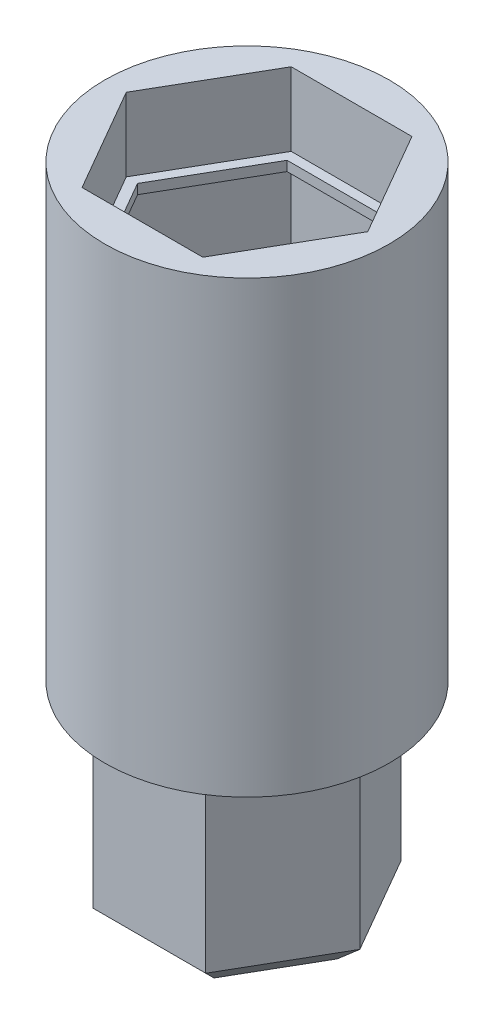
ISO-10303-21;
HEADER;
FILE_DESCRIPTION(('STEP AP214'),'2;1');
FILE_NAME('part.step','',(''),(''),'','','');
FILE_SCHEMA(('AUTOMOTIVE_DESIGN { 1 0 10303 214 1 1 1 1 }'));
ENDSEC;
DATA;
#1=APPLICATION_CONTEXT('core data for automotive mechanical design processes');
#2=APPLICATION_PROTOCOL_DEFINITION('international standard','automotive_design',2000,#1);
#3=PRODUCT_CONTEXT('',#1,'mechanical');
#4=PRODUCT('Part','Part','',(#3));
#5=PRODUCT_RELATED_PRODUCT_CATEGORY('part','',(#4));
#6=PRODUCT_DEFINITION_FORMATION('','',#4);
#7=PRODUCT_DEFINITION_CONTEXT('part definition',#1,'design');
#8=PRODUCT_DEFINITION('design','',#6,#7);
#9=PRODUCT_DEFINITION_SHAPE('','',#8);
#10=(LENGTH_UNIT() NAMED_UNIT(*) SI_UNIT(.MILLI.,.METRE.));
#11=(NAMED_UNIT(*) PLANE_ANGLE_UNIT() SI_UNIT($,.RADIAN.));
#12=(NAMED_UNIT(*) SI_UNIT($,.STERADIAN.) SOLID_ANGLE_UNIT());
#13=UNCERTAINTY_MEASURE_WITH_UNIT(LENGTH_MEASURE(1.E-05),#10,'distance_accuracy_value','');
#14=(GEOMETRIC_REPRESENTATION_CONTEXT(3) GLOBAL_UNCERTAINTY_ASSIGNED_CONTEXT((#13)) GLOBAL_UNIT_ASSIGNED_CONTEXT((#10,
#11,#12)) REPRESENTATION_CONTEXT('',''));
#15=CARTESIAN_POINT('',(0.,0.,0.));
#16=DIRECTION('',(0.,0.,1.));
#17=DIRECTION('',(1.,0.,0.));
#18=AXIS2_PLACEMENT_3D('',#15,#16,#17);
#19=CARTESIAN_POINT('',(0.,0.,0.));
#20=DIRECTION('',(0.,1.,0.));
#21=DIRECTION('',(0.,0.,1.));
#22=AXIS2_PLACEMENT_3D('',#19,#20,#21);
#23=PLANE('',#22);
#24=DIRECTION('',(-0.5,0.,-0.866025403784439));
#25=VECTOR('',#24,1.);
#26=CARTESIAN_POINT('',(9.5320529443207,0.,-13.97));
#27=LINE('',#26,#25);
#28=CARTESIAN_POINT('',(17.5976362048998,0.,0.));
#29=VERTEX_POINT('',#28);
#30=CARTESIAN_POINT('',(8.79881810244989,0.,-15.24));
#31=VERTEX_POINT('',#30);
#32=EDGE_CURVE('E445',#29,#31,#27,.T.);
#33=ORIENTED_EDGE('',*,*,#32,.T.);
#34=DIRECTION('',(-1.,0.,0.));
#35=VECTOR('',#34,1.);
#36=CARTESIAN_POINT('',(-7.33234841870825,0.,-15.24));
#37=LINE('',#36,#35);
#38=CARTESIAN_POINT('',(-8.79881810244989,0.,-15.24));
#39=VERTEX_POINT('',#38);
#40=EDGE_CURVE('E453',#31,#39,#37,.T.);
#41=ORIENTED_EDGE('',*,*,#40,.T.);
#42=DIRECTION('',(-0.5,0.,0.866025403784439));
#43=VECTOR('',#42,1.);
#44=CARTESIAN_POINT('',(-16.864401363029,0.,-1.26999999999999));
#45=LINE('',#44,#43);
#46=CARTESIAN_POINT('',(-17.5976362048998,0.,0.));
#47=VERTEX_POINT('',#46);
#48=EDGE_CURVE('E451',#39,#47,#45,.T.);
#49=ORIENTED_EDGE('',*,*,#48,.T.);
#50=DIRECTION('',(0.5,0.,0.866025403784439));
#51=VECTOR('',#50,1.);
#52=CARTESIAN_POINT('',(-9.53205294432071,0.,13.97));
#53=LINE('',#52,#51);
#54=CARTESIAN_POINT('',(-8.79881810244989,0.,15.24));
#55=VERTEX_POINT('',#54);
#56=EDGE_CURVE('E449',#47,#55,#53,.T.);
#57=ORIENTED_EDGE('',*,*,#56,.T.);
#58=DIRECTION('',(1.,0.,0.));
#59=VECTOR('',#58,1.);
#60=CARTESIAN_POINT('',(7.33234841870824,0.,15.24));
#61=LINE('',#60,#59);
#62=CARTESIAN_POINT('',(8.79881810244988,0.,15.24));
#63=VERTEX_POINT('',#62);
#64=EDGE_CURVE('E447',#55,#63,#61,.T.);
#65=ORIENTED_EDGE('',*,*,#64,.T.);
#66=DIRECTION('',(0.5,0.,-0.866025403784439));
#67=VECTOR('',#66,1.);
#68=CARTESIAN_POINT('',(16.8644013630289,0.,1.27));
#69=LINE('',#68,#67);
#70=EDGE_CURVE('E443',#63,#29,#69,.T.);
#71=ORIENTED_EDGE('',*,*,#70,.T.);
#72=EDGE_LOOP('',(#33,#41,#49,#57,#65,#71));
#73=FACE_BOUND('',#72,.T.);
#74=CARTESIAN_POINT('',(0.,0.,0.));
#75=DIRECTION('',(0.,1.,0.));
#76=DIRECTION('',(0.,0.,1.));
#77=AXIS2_PLACEMENT_3D('',#74,#75,#76);
#78=CIRCLE('',#77,18.4785);
#79=CARTESIAN_POINT('',(0.,0.,-18.4785));
#80=VERTEX_POINT('',#79);
#81=EDGE_CURVE('E384',#80,#80,#78,.T.);
#82=ORIENTED_EDGE('',*,*,#81,.F.);
#83=EDGE_LOOP('',(#82));
#84=FACE_BOUND('',#83,.T.);
#85=ADVANCED_FACE('F33',(#73,#84),#23,.F.);
#86=CARTESIAN_POINT('',(0.,58.42,0.));
#87=DIRECTION('',(0.,-1.,0.));
#88=DIRECTION('',(0.,0.,-1.));
#89=AXIS2_PLACEMENT_3D('',#86,#87,#88);
#90=CYLINDRICAL_SURFACE('',#89,18.4785);
#91=CARTESIAN_POINT('',(0.,58.42,0.));
#92=DIRECTION('',(0.,1.,0.));
#93=DIRECTION('',(0.,0.,1.));
#94=AXIS2_PLACEMENT_3D('',#91,#92,#93);
#95=CIRCLE('',#94,18.4785);
#96=CARTESIAN_POINT('',(0.,58.42,-18.4785));
#97=VERTEX_POINT('',#96);
#98=EDGE_CURVE('E395',#97,#97,#95,.T.);
#99=CARTESIAN_POINT('',(0.,58.42,-18.4785));
#100=CARTESIAN_POINT('',(0.,57.8114583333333,-18.4785));
#101=CARTESIAN_POINT('',(0.,57.2029166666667,-18.4785));
#102=CARTESIAN_POINT('',(0.,55.9858333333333,-18.4785));
#103=CARTESIAN_POINT('',(0.,55.3772916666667,-18.4785));
#104=CARTESIAN_POINT('',(0.,54.1602083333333,-18.4785));
#105=CARTESIAN_POINT('',(0.,53.5516666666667,-18.4785));
#106=CARTESIAN_POINT('',(0.,52.3345833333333,-18.4785));
#107=CARTESIAN_POINT('',(0.,51.7260416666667,-18.4785));
#108=CARTESIAN_POINT('',(0.,50.5089583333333,-18.4785));
#109=CARTESIAN_POINT('',(0.,49.9004166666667,-18.4785));
#110=CARTESIAN_POINT('',(0.,48.6833333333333,-18.4785));
#111=CARTESIAN_POINT('',(0.,48.0747916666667,-18.4785));
#112=CARTESIAN_POINT('',(0.,46.8577083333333,-18.4785));
#113=CARTESIAN_POINT('',(0.,46.2491666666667,-18.4785));
#114=CARTESIAN_POINT('',(0.,45.0320833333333,-18.4785));
#115=CARTESIAN_POINT('',(0.,44.4235416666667,-18.4785));
#116=CARTESIAN_POINT('',(0.,43.2064583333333,-18.4785));
#117=CARTESIAN_POINT('',(0.,42.5979166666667,-18.4785));
#118=CARTESIAN_POINT('',(0.,41.3808333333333,-18.4785));
#119=CARTESIAN_POINT('',(0.,40.7722916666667,-18.4785));
#120=CARTESIAN_POINT('',(0.,39.5552083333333,-18.4785));
#121=CARTESIAN_POINT('',(0.,38.9466666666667,-18.4785));
#122=CARTESIAN_POINT('',(0.,37.7295833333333,-18.4785));
#123=CARTESIAN_POINT('',(0.,37.1210416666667,-18.4785));
#124=CARTESIAN_POINT('',(0.,35.9039583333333,-18.4785));
#125=CARTESIAN_POINT('',(0.,35.2954166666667,-18.4785));
#126=CARTESIAN_POINT('',(0.,34.0783333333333,-18.4785));
#127=CARTESIAN_POINT('',(0.,33.4697916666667,-18.4785));
#128=CARTESIAN_POINT('',(0.,32.2527083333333,-18.4785));
#129=CARTESIAN_POINT('',(0.,31.6441666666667,-18.4785));
#130=CARTESIAN_POINT('',(0.,30.4270833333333,-18.4785));
#131=CARTESIAN_POINT('',(0.,29.8185416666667,-18.4785));
#132=CARTESIAN_POINT('',(0.,28.6014583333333,-18.4785));
#133=CARTESIAN_POINT('',(0.,27.9929166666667,-18.4785));
#134=CARTESIAN_POINT('',(0.,26.7758333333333,-18.4785));
#135=CARTESIAN_POINT('',(0.,26.1672916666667,-18.4785));
#136=CARTESIAN_POINT('',(0.,24.9502083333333,-18.4785));
#137=CARTESIAN_POINT('',(0.,24.3416666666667,-18.4785));
#138=CARTESIAN_POINT('',(0.,23.1245833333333,-18.4785));
#139=CARTESIAN_POINT('',(0.,22.5160416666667,-18.4785));
#140=CARTESIAN_POINT('',(0.,21.2989583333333,-18.4785));
#141=CARTESIAN_POINT('',(0.,20.6904166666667,-18.4785));
#142=CARTESIAN_POINT('',(0.,19.4733333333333,-18.4785));
#143=CARTESIAN_POINT('',(0.,18.8647916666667,-18.4785));
#144=CARTESIAN_POINT('',(0.,17.6477083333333,-18.4785));
#145=CARTESIAN_POINT('',(0.,17.0391666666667,-18.4785));
#146=CARTESIAN_POINT('',(0.,15.8220833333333,-18.4785));
#147=CARTESIAN_POINT('',(0.,15.2135416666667,-18.4785));
#148=CARTESIAN_POINT('',(0.,13.9964583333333,-18.4785));
#149=CARTESIAN_POINT('',(0.,13.3879166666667,-18.4785));
#150=CARTESIAN_POINT('',(0.,12.1708333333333,-18.4785));
#151=CARTESIAN_POINT('',(0.,11.5622916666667,-18.4785));
#152=CARTESIAN_POINT('',(0.,10.3452083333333,-18.4785));
#153=CARTESIAN_POINT('',(0.,9.73666666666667,-18.4785));
#154=CARTESIAN_POINT('',(0.,8.51958333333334,-18.4785));
#155=CARTESIAN_POINT('',(0.,7.91104166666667,-18.4785));
#156=CARTESIAN_POINT('',(0.,6.69395833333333,-18.4785));
#157=CARTESIAN_POINT('',(0.,6.08541666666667,-18.4785));
#158=CARTESIAN_POINT('',(0.,4.86833333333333,-18.4785));
#159=CARTESIAN_POINT('',(0.,4.25979166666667,-18.4785));
#160=CARTESIAN_POINT('',(0.,3.04270833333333,-18.4785));
#161=CARTESIAN_POINT('',(0.,2.43416666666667,-18.4785));
#162=CARTESIAN_POINT('',(0.,1.21708333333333,-18.4785));
#163=CARTESIAN_POINT('',(0.,0.608541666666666,-18.4785));
#164=CARTESIAN_POINT('',(0.,0.,-18.4785));
#165=B_SPLINE_CURVE_WITH_KNOTS('',3,(#99,#100,#101,#102,#103,#104,#105,#106,#107,#108,#109,#110,
#111,#112,#113,#114,#115,#116,#117,#118,#119,#120,#121,#122,#123,#124,#125,#126,#127,#128,#129,
#130,#131,#132,#133,#134,#135,#136,#137,#138,#139,#140,#141,#142,#143,#144,#145,#146,#147,#148,
#149,#150,#151,#152,#153,#154,#155,#156,#157,#158,#159,#160,#161,#162,#163,#164),.UNSPECIFIED.,
.F.,.F.,(4,2,2,2,2,2,2,2,2,2,2,2,2,2,2,2,2,2,2,2,2,2,2,2,2,2,2,2,2,2,2,2,4),(0.,1.825625,
3.65125,5.476875,7.3025,9.128125,10.95375,12.779375,14.605,16.430625,18.25625,20.081875,21.9075,
23.733125,25.55875,27.384375,29.21,31.035625,32.86125,34.686875,36.5125,38.338125,40.16375,
41.989375,43.815,45.640625,47.46625,49.291875,51.1175,52.943125,54.76875,56.594375,58.42),.UNSPECIFIED.);
#166=EDGE_CURVE('BSEAM601',#97,#80,#165,.T.);
#167=ORIENTED_EDGE('',*,*,#98,.F.);
#168=ORIENTED_EDGE('',*,*,#81,.T.);
#169=ORIENTED_EDGE('',*,*,#166,.T.);
#170=ORIENTED_EDGE('',*,*,#166,.F.);
#171=EDGE_LOOP('',(#167,#169,#168,#170));
#172=FACE_BOUND('',#171,.T.);
#173=ADVANCED_FACE('F601',(#172),#90,.T.);
#174=CARTESIAN_POINT('',(0.,58.42,0.));
#175=DIRECTION('',(0.,1.,0.));
#176=DIRECTION('',(0.,0.,1.));
#177=AXIS2_PLACEMENT_3D('',#174,#175,#176);
#178=PLANE('',#177);
#179=DIRECTION('',(0.5,0.,-0.866025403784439));
#180=VECTOR('',#179,1.);
#181=CARTESIAN_POINT('',(7.84561280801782,58.42,13.589));
#182=LINE('',#181,#180);
#183=CARTESIAN_POINT('',(7.84561280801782,58.42,13.589));
#184=VERTEX_POINT('',#183);
#185=CARTESIAN_POINT('',(15.6912256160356,58.42,0.));
#186=VERTEX_POINT('',#185);
#187=EDGE_CURVE('E337',#184,#186,#182,.T.);
#188=ORIENTED_EDGE('',*,*,#187,.F.);
#189=DIRECTION('',(1.,0.,0.));
#190=VECTOR('',#189,1.);
#191=CARTESIAN_POINT('',(-7.84561280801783,58.42,13.589));
#192=LINE('',#191,#190);
#193=CARTESIAN_POINT('',(-7.84561280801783,58.42,13.589));
#194=VERTEX_POINT('',#193);
#195=EDGE_CURVE('E351',#194,#184,#192,.T.);
#196=ORIENTED_EDGE('',*,*,#195,.F.);
#197=DIRECTION('',(0.5,0.,0.866025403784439));
#198=VECTOR('',#197,1.);
#199=CARTESIAN_POINT('',(-15.6912256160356,58.42,0.));
#200=LINE('',#199,#198);
#201=CARTESIAN_POINT('',(-15.6912256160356,58.42,0.));
#202=VERTEX_POINT('',#201);
#203=EDGE_CURVE('E377',#202,#194,#200,.T.);
#204=ORIENTED_EDGE('',*,*,#203,.F.);
#205=DIRECTION('',(-0.5,0.,0.866025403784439));
#206=VECTOR('',#205,1.);
#207=CARTESIAN_POINT('',(-7.84561280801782,58.42,-13.589));
#208=LINE('',#207,#206);
#209=CARTESIAN_POINT('',(-7.84561280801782,58.42,-13.589));
#210=VERTEX_POINT('',#209);
#211=EDGE_CURVE('E374',#210,#202,#208,.T.);
#212=ORIENTED_EDGE('',*,*,#211,.F.);
#213=DIRECTION('',(-1.,0.,0.));
#214=VECTOR('',#213,1.);
#215=CARTESIAN_POINT('',(7.84561280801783,58.42,-13.589));
#216=LINE('',#215,#214);
#217=CARTESIAN_POINT('',(7.84561280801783,58.42,-13.589));
#218=VERTEX_POINT('',#217);
#219=EDGE_CURVE('E371',#218,#210,#216,.T.);
#220=ORIENTED_EDGE('',*,*,#219,.F.);
#221=DIRECTION('',(-0.5,0.,-0.866025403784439));
#222=VECTOR('',#221,1.);
#223=CARTESIAN_POINT('',(15.6912256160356,58.42,0.));
#224=LINE('',#223,#222);
#225=EDGE_CURVE('E368',#186,#218,#224,.T.);
#226=ORIENTED_EDGE('',*,*,#225,.F.);
#227=EDGE_LOOP('',(#188,#196,#204,#212,#220,#226));
#228=FACE_BOUND('',#227,.T.);
#229=ORIENTED_EDGE('',*,*,#98,.T.);
#230=EDGE_LOOP('',(#229));
#231=FACE_BOUND('',#230,.T.);
#232=ADVANCED_FACE('F606',(#228,#231),#178,.T.);
#233=CARTESIAN_POINT('',(7.84561280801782,48.895,13.589));
#234=DIRECTION('',(0.866025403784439,0.,0.5));
#235=DIRECTION('',(0.5,0.,-0.866025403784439));
#236=AXIS2_PLACEMENT_3D('',#233,#234,#235);
#237=PLANE('',#236);
#238=ORIENTED_EDGE('',*,*,#187,.T.);
#239=DIRECTION('',(0.,1.,0.));
#240=VECTOR('',#239,1.);
#241=CARTESIAN_POINT('',(15.6912256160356,48.895,0.));
#242=LINE('',#241,#240);
#243=CARTESIAN_POINT('',(15.6912256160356,48.895,0.));
#244=VERTEX_POINT('',#243);
#245=EDGE_CURVE('E366',#244,#186,#242,.T.);
#246=ORIENTED_EDGE('',*,*,#245,.F.);
#247=DIRECTION('',(0.5,0.,-0.866025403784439));
#248=VECTOR('',#247,1.);
#249=CARTESIAN_POINT('',(7.84561280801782,48.895,13.589));
#250=LINE('',#249,#248);
#251=CARTESIAN_POINT('',(7.84561280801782,48.895,13.589));
#252=VERTEX_POINT('',#251);
#253=EDGE_CURVE('E347',#252,#244,#250,.T.);
#254=ORIENTED_EDGE('',*,*,#253,.F.);
#255=DIRECTION('',(0.,1.,0.));
#256=VECTOR('',#255,1.);
#257=CARTESIAN_POINT('',(7.84561280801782,48.895,13.589));
#258=LINE('',#257,#256);
#259=EDGE_CURVE('E382',#252,#184,#258,.T.);
#260=ORIENTED_EDGE('',*,*,#259,.T.);
#261=EDGE_LOOP('',(#238,#246,#254,#260));
#262=FACE_BOUND('',#261,.T.);
#263=ADVANCED_FACE('F983',(#262),#237,.F.);
#264=CARTESIAN_POINT('',(-7.84561280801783,48.895,13.589));
#265=DIRECTION('',(0.,0.,1.));
#266=DIRECTION('',(1.,0.,0.));
#267=AXIS2_PLACEMENT_3D('',#264,#265,#266);
#268=PLANE('',#267);
#269=ORIENTED_EDGE('',*,*,#195,.T.);
#270=ORIENTED_EDGE('',*,*,#259,.F.);
#271=DIRECTION('',(1.,0.,0.));
#272=VECTOR('',#271,1.);
#273=CARTESIAN_POINT('',(-7.84561280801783,48.895,13.589));
#274=LINE('',#273,#272);
#275=CARTESIAN_POINT('',(-7.84561280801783,48.895,13.589));
#276=VERTEX_POINT('',#275);
#277=EDGE_CURVE('E363',#276,#252,#274,.T.);
#278=ORIENTED_EDGE('',*,*,#277,.F.);
#279=DIRECTION('',(0.,1.,0.));
#280=VECTOR('',#279,1.);
#281=CARTESIAN_POINT('',(-7.84561280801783,48.895,13.589));
#282=LINE('',#281,#280);
#283=EDGE_CURVE('E385',#276,#194,#282,.T.);
#284=ORIENTED_EDGE('',*,*,#283,.T.);
#285=EDGE_LOOP('',(#269,#270,#278,#284));
#286=FACE_BOUND('',#285,.T.);
#287=ADVANCED_FACE('F974',(#286),#268,.F.);
#288=CARTESIAN_POINT('',(-15.6912256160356,48.895,0.));
#289=DIRECTION('',(-0.866025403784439,0.,0.5));
#290=DIRECTION('',(0.5,0.,0.866025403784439));
#291=AXIS2_PLACEMENT_3D('',#288,#289,#290);
#292=PLANE('',#291);
#293=ORIENTED_EDGE('',*,*,#203,.T.);
#294=ORIENTED_EDGE('',*,*,#283,.F.);
#295=DIRECTION('',(0.5,0.,0.866025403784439));
#296=VECTOR('',#295,1.);
#297=CARTESIAN_POINT('',(-15.6912256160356,48.895,0.));
#298=LINE('',#297,#296);
#299=CARTESIAN_POINT('',(-15.6912256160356,48.895,0.));
#300=VERTEX_POINT('',#299);
#301=EDGE_CURVE('E360',#300,#276,#298,.T.);
#302=ORIENTED_EDGE('',*,*,#301,.F.);
#303=DIRECTION('',(0.,1.,0.));
#304=VECTOR('',#303,1.);
#305=CARTESIAN_POINT('',(-15.6912256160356,48.895,0.));
#306=LINE('',#305,#304);
#307=EDGE_CURVE('E387',#300,#202,#306,.T.);
#308=ORIENTED_EDGE('',*,*,#307,.T.);
#309=EDGE_LOOP('',(#293,#294,#302,#308));
#310=FACE_BOUND('',#309,.T.);
#311=ADVANCED_FACE('F965',(#310),#292,.F.);
#312=CARTESIAN_POINT('',(-7.84561280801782,48.895,-13.589));
#313=DIRECTION('',(-0.866025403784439,0.,-0.5));
#314=DIRECTION('',(-0.5,0.,0.866025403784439));
#315=AXIS2_PLACEMENT_3D('',#312,#313,#314);
#316=PLANE('',#315);
#317=ORIENTED_EDGE('',*,*,#211,.T.);
#318=ORIENTED_EDGE('',*,*,#307,.F.);
#319=DIRECTION('',(-0.5,0.,0.866025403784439));
#320=VECTOR('',#319,1.);
#321=CARTESIAN_POINT('',(-7.84561280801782,48.895,-13.589));
#322=LINE('',#321,#320);
#323=CARTESIAN_POINT('',(-7.84561280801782,48.895,-13.589));
#324=VERTEX_POINT('',#323);
#325=EDGE_CURVE('E357',#324,#300,#322,.T.);
#326=ORIENTED_EDGE('',*,*,#325,.F.);
#327=DIRECTION('',(0.,1.,0.));
#328=VECTOR('',#327,1.);
#329=CARTESIAN_POINT('',(-7.84561280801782,48.895,-13.589));
#330=LINE('',#329,#328);
#331=EDGE_CURVE('E389',#324,#210,#330,.T.);
#332=ORIENTED_EDGE('',*,*,#331,.T.);
#333=EDGE_LOOP('',(#317,#318,#326,#332));
#334=FACE_BOUND('',#333,.T.);
#335=ADVANCED_FACE('F956',(#334),#316,.F.);
#336=CARTESIAN_POINT('',(7.84561280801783,48.895,-13.589));
#337=DIRECTION('',(0.,0.,-1.));
#338=DIRECTION('',(-1.,0.,0.));
#339=AXIS2_PLACEMENT_3D('',#336,#337,#338);
#340=PLANE('',#339);
#341=ORIENTED_EDGE('',*,*,#219,.T.);
#342=ORIENTED_EDGE('',*,*,#331,.F.);
#343=DIRECTION('',(-1.,0.,0.));
#344=VECTOR('',#343,1.);
#345=CARTESIAN_POINT('',(7.84561280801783,48.895,-13.589));
#346=LINE('',#345,#344);
#347=CARTESIAN_POINT('',(7.84561280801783,48.895,-13.589));
#348=VERTEX_POINT('',#347);
#349=EDGE_CURVE('E354',#348,#324,#346,.T.);
#350=ORIENTED_EDGE('',*,*,#349,.F.);
#351=DIRECTION('',(0.,1.,0.));
#352=VECTOR('',#351,1.);
#353=CARTESIAN_POINT('',(7.84561280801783,48.895,-13.589));
#354=LINE('',#353,#352);
#355=EDGE_CURVE('E391',#348,#218,#354,.T.);
#356=ORIENTED_EDGE('',*,*,#355,.T.);
#357=EDGE_LOOP('',(#341,#342,#350,#356));
#358=FACE_BOUND('',#357,.T.);
#359=ADVANCED_FACE('F947',(#358),#340,.F.);
#360=CARTESIAN_POINT('',(15.6912256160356,48.895,0.));
#361=DIRECTION('',(0.866025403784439,0.,-0.5));
#362=DIRECTION('',(-0.5,0.,-0.866025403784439));
#363=AXIS2_PLACEMENT_3D('',#360,#361,#362);
#364=PLANE('',#363);
#365=ORIENTED_EDGE('',*,*,#225,.T.);
#366=ORIENTED_EDGE('',*,*,#355,.F.);
#367=DIRECTION('',(-0.5,0.,-0.866025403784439));
#368=VECTOR('',#367,1.);
#369=CARTESIAN_POINT('',(15.6912256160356,48.895,0.));
#370=LINE('',#369,#368);
#371=EDGE_CURVE('E350',#244,#348,#370,.T.);
#372=ORIENTED_EDGE('',*,*,#371,.F.);
#373=ORIENTED_EDGE('',*,*,#245,.T.);
#374=EDGE_LOOP('',(#365,#366,#372,#373));
#375=FACE_BOUND('',#374,.T.);
#376=ADVANCED_FACE('F938',(#375),#364,.F.);
#377=CARTESIAN_POINT('',(0.,48.895,0.));
#378=DIRECTION('',(0.,1.,0.));
#379=DIRECTION('',(0.,0.,1.));
#380=AXIS2_PLACEMENT_3D('',#377,#378,#379);
#381=PLANE('',#380);
#382=DIRECTION('',(0.5,0.,-0.866025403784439));
#383=VECTOR('',#382,1.);
#384=CARTESIAN_POINT('',(7.112377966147,48.895,12.319));
#385=LINE('',#384,#383);
#386=CARTESIAN_POINT('',(7.112377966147,48.895,12.319));
#387=VERTEX_POINT('',#386);
#388=CARTESIAN_POINT('',(14.224755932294,48.895,0.));
#389=VERTEX_POINT('',#388);
#390=EDGE_CURVE('E316',#387,#389,#385,.T.);
#391=ORIENTED_EDGE('',*,*,#390,.F.);
#392=DIRECTION('',(1.,0.,0.));
#393=VECTOR('',#392,1.);
#394=CARTESIAN_POINT('',(-7.112377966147,48.895,12.319));
#395=LINE('',#394,#393);
#396=CARTESIAN_POINT('',(-7.112377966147,48.895,12.319));
#397=VERTEX_POINT('',#396);
#398=EDGE_CURVE('E331',#397,#387,#395,.T.);
#399=ORIENTED_EDGE('',*,*,#398,.F.);
#400=DIRECTION('',(0.5,0.,0.866025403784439));
#401=VECTOR('',#400,1.);
#402=CARTESIAN_POINT('',(-14.224755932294,48.895,0.));
#403=LINE('',#402,#401);
#404=CARTESIAN_POINT('',(-14.224755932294,48.895,0.));
#405=VERTEX_POINT('',#404);
#406=EDGE_CURVE('E328',#405,#397,#403,.T.);
#407=ORIENTED_EDGE('',*,*,#406,.F.);
#408=DIRECTION('',(-0.5,0.,0.866025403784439));
#409=VECTOR('',#408,1.);
#410=CARTESIAN_POINT('',(-7.112377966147,48.895,-12.319));
#411=LINE('',#410,#409);
#412=CARTESIAN_POINT('',(-7.112377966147,48.895,-12.319));
#413=VERTEX_POINT('',#412);
#414=EDGE_CURVE('E325',#413,#405,#411,.T.);
#415=ORIENTED_EDGE('',*,*,#414,.F.);
#416=DIRECTION('',(-1.,0.,0.));
#417=VECTOR('',#416,1.);
#418=CARTESIAN_POINT('',(7.112377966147,48.895,-12.319));
#419=LINE('',#418,#417);
#420=CARTESIAN_POINT('',(7.112377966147,48.895,-12.319));
#421=VERTEX_POINT('',#420);
#422=EDGE_CURVE('E322',#421,#413,#419,.T.);
#423=ORIENTED_EDGE('',*,*,#422,.F.);
#424=DIRECTION('',(-0.5,0.,-0.866025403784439));
#425=VECTOR('',#424,1.);
#426=CARTESIAN_POINT('',(14.224755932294,48.895,0.));
#427=LINE('',#426,#425);
#428=EDGE_CURVE('E319',#389,#421,#427,.T.);
#429=ORIENTED_EDGE('',*,*,#428,.F.);
#430=EDGE_LOOP('',(#391,#399,#407,#415,#423,#429));
#431=FACE_BOUND('',#430,.T.);
#432=ORIENTED_EDGE('',*,*,#253,.T.);
#433=ORIENTED_EDGE('',*,*,#371,.T.);
#434=ORIENTED_EDGE('',*,*,#349,.T.);
#435=ORIENTED_EDGE('',*,*,#325,.T.);
#436=ORIENTED_EDGE('',*,*,#301,.T.);
#437=ORIENTED_EDGE('',*,*,#277,.T.);
#438=EDGE_LOOP('',(#432,#433,#434,#435,#436,#437));
#439=FACE_BOUND('',#438,.T.);
#440=ADVANCED_FACE('F929',(#431,#439),#381,.T.);
#441=CARTESIAN_POINT('',(7.112377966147,10.795,12.319));
#442=DIRECTION('',(0.866025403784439,0.,0.5));
#443=DIRECTION('',(0.5,0.,-0.866025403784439));
#444=AXIS2_PLACEMENT_3D('',#441,#442,#443);
#445=PLANE('',#444);
#446=DIRECTION('',(0.,1.,0.));
#447=VECTOR('',#446,1.);
#448=CARTESIAN_POINT('',(14.224755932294,10.795,0.));
#449=LINE('',#448,#447);
#450=CARTESIAN_POINT('',(14.224755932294,47.625,0.));
#451=VERTEX_POINT('',#450);
#452=EDGE_CURVE('E334',#451,#389,#449,.T.);
#453=ORIENTED_EDGE('',*,*,#452,.F.);
#454=DIRECTION('',(-0.5,0.,0.866025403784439));
#455=VECTOR('',#454,1.);
#456=CARTESIAN_POINT('',(7.112377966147,47.625,12.319));
#457=LINE('',#456,#455);
#458=CARTESIAN_POINT('',(7.112377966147,47.625,12.319));
#459=VERTEX_POINT('',#458);
#460=EDGE_CURVE('E313',#451,#459,#457,.T.);
#461=ORIENTED_EDGE('',*,*,#460,.T.);
#462=DIRECTION('',(0.,1.,0.));
#463=VECTOR('',#462,1.);
#464=CARTESIAN_POINT('',(7.112377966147,10.795,12.319));
#465=LINE('',#464,#463);
#466=EDGE_CURVE('E335',#459,#387,#465,.T.);
#467=ORIENTED_EDGE('',*,*,#466,.T.);
#468=ORIENTED_EDGE('',*,*,#390,.T.);
#469=EDGE_LOOP('',(#453,#461,#467,#468));
#470=FACE_BOUND('',#469,.T.);
#471=ADVANCED_FACE('F920',(#470),#445,.F.);
#472=CARTESIAN_POINT('',(-7.112377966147,10.795,12.319));
#473=DIRECTION('',(0.,0.,1.));
#474=DIRECTION('',(1.,0.,0.));
#475=AXIS2_PLACEMENT_3D('',#472,#473,#474);
#476=PLANE('',#475);
#477=ORIENTED_EDGE('',*,*,#466,.F.);
#478=DIRECTION('',(-1.,0.,0.));
#479=VECTOR('',#478,1.);
#480=CARTESIAN_POINT('',(-7.112377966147,47.625,12.319));
#481=LINE('',#480,#479);
#482=CARTESIAN_POINT('',(-7.11237796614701,47.625,12.319));
#483=VERTEX_POINT('',#482);
#484=EDGE_CURVE('E310',#459,#483,#481,.T.);
#485=ORIENTED_EDGE('',*,*,#484,.T.);
#486=DIRECTION('',(0.,1.,0.));
#487=VECTOR('',#486,1.);
#488=CARTESIAN_POINT('',(-7.112377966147,10.795,12.319));
#489=LINE('',#488,#487);
#490=EDGE_CURVE('E338',#483,#397,#489,.T.);
#491=ORIENTED_EDGE('',*,*,#490,.T.);
#492=ORIENTED_EDGE('',*,*,#398,.T.);
#493=EDGE_LOOP('',(#477,#485,#491,#492));
#494=FACE_BOUND('',#493,.T.);
#495=ADVANCED_FACE('F911',(#494),#476,.F.);
#496=CARTESIAN_POINT('',(-14.224755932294,10.795,0.));
#497=DIRECTION('',(-0.866025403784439,0.,0.5));
#498=DIRECTION('',(0.5,0.,0.866025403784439));
#499=AXIS2_PLACEMENT_3D('',#496,#497,#498);
#500=PLANE('',#499);
#501=ORIENTED_EDGE('',*,*,#490,.F.);
#502=DIRECTION('',(-0.5,0.,-0.866025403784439));
#503=VECTOR('',#502,1.);
#504=CARTESIAN_POINT('',(-14.224755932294,47.625,0.));
#505=LINE('',#504,#503);
#506=CARTESIAN_POINT('',(-14.224755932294,47.625,0.));
#507=VERTEX_POINT('',#506);
#508=EDGE_CURVE('E307',#483,#507,#505,.T.);
#509=ORIENTED_EDGE('',*,*,#508,.T.);
#510=DIRECTION('',(0.,1.,0.));
#511=VECTOR('',#510,1.);
#512=CARTESIAN_POINT('',(-14.224755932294,10.795,0.));
#513=LINE('',#512,#511);
#514=EDGE_CURVE('E340',#507,#405,#513,.T.);
#515=ORIENTED_EDGE('',*,*,#514,.T.);
#516=ORIENTED_EDGE('',*,*,#406,.T.);
#517=EDGE_LOOP('',(#501,#509,#515,#516));
#518=FACE_BOUND('',#517,.T.);
#519=ADVANCED_FACE('F902',(#518),#500,.F.);
#520=CARTESIAN_POINT('',(-7.112377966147,10.795,-12.319));
#521=DIRECTION('',(-0.866025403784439,0.,-0.5));
#522=DIRECTION('',(-0.5,0.,0.866025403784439));
#523=AXIS2_PLACEMENT_3D('',#520,#521,#522);
#524=PLANE('',#523);
#525=ORIENTED_EDGE('',*,*,#514,.F.);
#526=DIRECTION('',(0.5,0.,-0.866025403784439));
#527=VECTOR('',#526,1.);
#528=CARTESIAN_POINT('',(-7.112377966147,47.625,-12.319));
#529=LINE('',#528,#527);
#530=CARTESIAN_POINT('',(-7.112377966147,47.625,-12.319));
#531=VERTEX_POINT('',#530);
#532=EDGE_CURVE('E304',#507,#531,#529,.T.);
#533=ORIENTED_EDGE('',*,*,#532,.T.);
#534=DIRECTION('',(0.,1.,0.));
#535=VECTOR('',#534,1.);
#536=CARTESIAN_POINT('',(-7.112377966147,10.795,-12.319));
#537=LINE('',#536,#535);
#538=EDGE_CURVE('E342',#531,#413,#537,.T.);
#539=ORIENTED_EDGE('',*,*,#538,.T.);
#540=ORIENTED_EDGE('',*,*,#414,.T.);
#541=EDGE_LOOP('',(#525,#533,#539,#540));
#542=FACE_BOUND('',#541,.T.);
#543=ADVANCED_FACE('F893',(#542),#524,.F.);
#544=CARTESIAN_POINT('',(7.112377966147,10.795,-12.319));
#545=DIRECTION('',(0.,0.,-1.));
#546=DIRECTION('',(-1.,0.,0.));
#547=AXIS2_PLACEMENT_3D('',#544,#545,#546);
#548=PLANE('',#547);
#549=ORIENTED_EDGE('',*,*,#538,.F.);
#550=DIRECTION('',(1.,0.,0.));
#551=VECTOR('',#550,1.);
#552=CARTESIAN_POINT('',(7.112377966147,47.625,-12.319));
#553=LINE('',#552,#551);
#554=CARTESIAN_POINT('',(7.112377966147,47.625,-12.319));
#555=VERTEX_POINT('',#554);
#556=EDGE_CURVE('E294',#531,#555,#553,.T.);
#557=ORIENTED_EDGE('',*,*,#556,.T.);
#558=DIRECTION('',(0.,1.,0.));
#559=VECTOR('',#558,1.);
#560=CARTESIAN_POINT('',(7.112377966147,10.795,-12.319));
#561=LINE('',#560,#559);
#562=EDGE_CURVE('E344',#555,#421,#561,.T.);
#563=ORIENTED_EDGE('',*,*,#562,.T.);
#564=ORIENTED_EDGE('',*,*,#422,.T.);
#565=EDGE_LOOP('',(#549,#557,#563,#564));
#566=FACE_BOUND('',#565,.T.);
#567=ADVANCED_FACE('F884',(#566),#548,.F.);
#568=CARTESIAN_POINT('',(14.224755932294,10.795,0.));
#569=DIRECTION('',(0.866025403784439,0.,-0.5));
#570=DIRECTION('',(-0.5,0.,-0.866025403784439));
#571=AXIS2_PLACEMENT_3D('',#568,#569,#570);
#572=PLANE('',#571);
#573=ORIENTED_EDGE('',*,*,#562,.F.);
#574=DIRECTION('',(0.5,0.,0.866025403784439));
#575=VECTOR('',#574,1.);
#576=CARTESIAN_POINT('',(14.224755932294,47.625,0.));
#577=LINE('',#576,#575);
#578=EDGE_CURVE('E398',#555,#451,#577,.T.);
#579=ORIENTED_EDGE('',*,*,#578,.T.);
#580=ORIENTED_EDGE('',*,*,#452,.T.);
#581=ORIENTED_EDGE('',*,*,#428,.T.);
#582=EDGE_LOOP('',(#573,#579,#580,#581));
#583=FACE_BOUND('',#582,.T.);
#584=ADVANCED_FACE('F876',(#583),#572,.F.);
#585=CARTESIAN_POINT('',(0.,47.625,0.));
#586=DIRECTION('',(0.,1.,0.));
#587=DIRECTION('',(0.,0.,1.));
#588=AXIS2_PLACEMENT_3D('',#585,#586,#587);
#589=PLANE('',#588);
#590=DIRECTION('',(0.499999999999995,0.,-0.866025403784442));
#591=VECTOR('',#590,1.);
#592=CARTESIAN_POINT('',(7.84561280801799,47.625,13.5889999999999));
#593=LINE('',#592,#591);
#594=CARTESIAN_POINT('',(7.84561280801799,47.625,13.5889999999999));
#595=VERTEX_POINT('',#594);
#596=CARTESIAN_POINT('',(15.6912256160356,47.625,0.));
#597=VERTEX_POINT('',#596);
#598=EDGE_CURVE('E267',#595,#597,#593,.T.);
#599=ORIENTED_EDGE('',*,*,#598,.F.);
#600=DIRECTION('',(1.,0.,0.));
#601=VECTOR('',#600,1.);
#602=CARTESIAN_POINT('',(-7.84561280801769,47.625,13.5890000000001));
#603=LINE('',#602,#601);
#604=CARTESIAN_POINT('',(-7.84561280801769,47.625,13.5890000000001));
#605=VERTEX_POINT('',#604);
#606=EDGE_CURVE('E259',#605,#595,#603,.T.);
#607=ORIENTED_EDGE('',*,*,#606,.F.);
#608=DIRECTION('',(0.500000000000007,0.,0.866025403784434));
#609=VECTOR('',#608,1.);
#610=CARTESIAN_POINT('',(-15.6912256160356,47.625,1.15884555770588E-13));
#611=LINE('',#610,#609);
#612=CARTESIAN_POINT('',(-15.6912256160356,47.625,1.15884555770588E-13));
#613=VERTEX_POINT('',#612);
#614=EDGE_CURVE('E289',#613,#605,#611,.T.);
#615=ORIENTED_EDGE('',*,*,#614,.F.);
#616=DIRECTION('',(-0.499999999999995,0.,0.866025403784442));
#617=VECTOR('',#616,1.);
#618=CARTESIAN_POINT('',(-7.84561280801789,47.625,-13.589));
#619=LINE('',#618,#617);
#620=CARTESIAN_POINT('',(-7.84561280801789,47.625,-13.589));
#621=VERTEX_POINT('',#620);
#622=EDGE_CURVE('E286',#621,#613,#619,.T.);
#623=ORIENTED_EDGE('',*,*,#622,.F.);
#624=DIRECTION('',(-1.,0.,0.));
#625=VECTOR('',#624,1.);
#626=CARTESIAN_POINT('',(7.84561280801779,47.625,-13.589));
#627=LINE('',#626,#625);
#628=CARTESIAN_POINT('',(7.84561280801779,47.625,-13.589));
#629=VERTEX_POINT('',#628);
#630=EDGE_CURVE('E271',#629,#621,#627,.T.);
#631=ORIENTED_EDGE('',*,*,#630,.F.);
#632=DIRECTION('',(-0.500000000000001,0.,-0.866025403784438));
#633=VECTOR('',#632,1.);
#634=CARTESIAN_POINT('',(15.6912256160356,47.625,0.));
#635=LINE('',#634,#633);
#636=EDGE_CURVE('E252',#597,#629,#635,.T.);
#637=ORIENTED_EDGE('',*,*,#636,.F.);
#638=EDGE_LOOP('',(#599,#607,#615,#623,#631,#637));
#639=FACE_BOUND('',#638,.T.);
#640=ORIENTED_EDGE('',*,*,#578,.F.);
#641=ORIENTED_EDGE('',*,*,#556,.F.);
#642=ORIENTED_EDGE('',*,*,#532,.F.);
#643=ORIENTED_EDGE('',*,*,#508,.F.);
#644=ORIENTED_EDGE('',*,*,#484,.F.);
#645=ORIENTED_EDGE('',*,*,#460,.F.);
#646=EDGE_LOOP('',(#640,#641,#642,#643,#644,#645));
#647=FACE_BOUND('',#646,.T.);
#648=ADVANCED_FACE('F264',(#639,#647),#589,.F.);
#649=CARTESIAN_POINT('',(7.84561280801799,9.52499999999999,13.5889999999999));
#650=DIRECTION('',(0.866025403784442,0.,0.499999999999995));
#651=DIRECTION('',(0.499999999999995,0.,-0.866025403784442));
#652=AXIS2_PLACEMENT_3D('',#649,#650,#651);
#653=PLANE('',#652);
#654=DIRECTION('',(0.,1.,0.));
#655=VECTOR('',#654,1.);
#656=CARTESIAN_POINT('',(15.6912256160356,9.52499999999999,0.));
#657=LINE('',#656,#655);
#658=CARTESIAN_POINT('',(15.6912256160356,12.065,0.));
#659=VERTEX_POINT('',#658);
#660=EDGE_CURVE('E248',#659,#597,#657,.T.);
#661=ORIENTED_EDGE('',*,*,#660,.F.);
#662=DIRECTION('',(-0.499999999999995,0.,0.866025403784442));
#663=VECTOR('',#662,1.);
#664=CARTESIAN_POINT('',(7.84561280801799,12.065,13.5889999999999));
#665=LINE('',#664,#663);
#666=CARTESIAN_POINT('',(7.84561280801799,12.065,13.5889999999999));
#667=VERTEX_POINT('',#666);
#668=EDGE_CURVE('E424',#659,#667,#665,.T.);
#669=ORIENTED_EDGE('',*,*,#668,.T.);
#670=DIRECTION('',(0.,1.,0.));
#671=VECTOR('',#670,1.);
#672=CARTESIAN_POINT('',(7.84561280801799,9.52499999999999,13.5889999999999));
#673=LINE('',#672,#671);
#674=EDGE_CURVE('E275',#667,#595,#673,.T.);
#675=ORIENTED_EDGE('',*,*,#674,.T.);
#676=ORIENTED_EDGE('',*,*,#598,.T.);
#677=EDGE_LOOP('',(#661,#669,#675,#676));
#678=FACE_BOUND('',#677,.T.);
#679=ADVANCED_FACE('F273',(#678),#653,.F.);
#680=CARTESIAN_POINT('',(-7.84561280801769,9.52499999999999,13.5890000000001));
#681=DIRECTION('',(0.,0.,1.));
#682=DIRECTION('',(1.,0.,0.));
#683=AXIS2_PLACEMENT_3D('',#680,#681,#682);
#684=PLANE('',#683);
#685=ORIENTED_EDGE('',*,*,#674,.F.);
#686=DIRECTION('',(-1.,0.,0.));
#687=VECTOR('',#686,1.);
#688=CARTESIAN_POINT('',(-7.84561280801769,12.065,13.5890000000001));
#689=LINE('',#688,#687);
#690=CARTESIAN_POINT('',(-7.84561280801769,12.065,13.5890000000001));
#691=VERTEX_POINT('',#690);
#692=EDGE_CURVE('E426',#667,#691,#689,.T.);
#693=ORIENTED_EDGE('',*,*,#692,.T.);
#694=DIRECTION('',(0.,1.,0.));
#695=VECTOR('',#694,1.);
#696=CARTESIAN_POINT('',(-7.84561280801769,9.52499999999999,13.5890000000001));
#697=LINE('',#696,#695);
#698=EDGE_CURVE('E295',#691,#605,#697,.T.);
#699=ORIENTED_EDGE('',*,*,#698,.T.);
#700=ORIENTED_EDGE('',*,*,#606,.T.);
#701=EDGE_LOOP('',(#685,#693,#699,#700));
#702=FACE_BOUND('',#701,.T.);
#703=ADVANCED_FACE('F852',(#702),#684,.F.);
#704=CARTESIAN_POINT('',(-15.6912256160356,9.52499999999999,1.15884555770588E-13));
#705=DIRECTION('',(-0.866025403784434,0.,0.500000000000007));
#706=DIRECTION('',(0.500000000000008,0.,0.866025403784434));
#707=AXIS2_PLACEMENT_3D('',#704,#705,#706);
#708=PLANE('',#707);
#709=ORIENTED_EDGE('',*,*,#698,.F.);
#710=DIRECTION('',(-0.500000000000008,0.,-0.866025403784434));
#711=VECTOR('',#710,1.);
#712=CARTESIAN_POINT('',(-15.6912256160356,12.065,1.15884555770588E-13));
#713=LINE('',#712,#711);
#714=CARTESIAN_POINT('',(-15.6912256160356,12.065,1.15884555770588E-13));
#715=VERTEX_POINT('',#714);
#716=EDGE_CURVE('E416',#691,#715,#713,.T.);
#717=ORIENTED_EDGE('',*,*,#716,.T.);
#718=DIRECTION('',(0.,1.,0.));
#719=VECTOR('',#718,1.);
#720=CARTESIAN_POINT('',(-15.6912256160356,9.52499999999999,1.15884555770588E-13));
#721=LINE('',#720,#719);
#722=EDGE_CURVE('E297',#715,#613,#721,.T.);
#723=ORIENTED_EDGE('',*,*,#722,.T.);
#724=ORIENTED_EDGE('',*,*,#614,.T.);
#725=EDGE_LOOP('',(#709,#717,#723,#724));
#726=FACE_BOUND('',#725,.T.);
#727=ADVANCED_FACE('F843',(#726),#708,.F.);
#728=CARTESIAN_POINT('',(-7.84561280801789,9.52499999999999,-13.589));
#729=DIRECTION('',(-0.866025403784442,0.,-0.499999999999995));
#730=DIRECTION('',(-0.499999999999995,0.,0.866025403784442));
#731=AXIS2_PLACEMENT_3D('',#728,#729,#730);
#732=PLANE('',#731);
#733=ORIENTED_EDGE('',*,*,#722,.F.);
#734=DIRECTION('',(0.499999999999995,0.,-0.866025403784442));
#735=VECTOR('',#734,1.);
#736=CARTESIAN_POINT('',(-7.84561280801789,12.065,-13.589));
#737=LINE('',#736,#735);
#738=CARTESIAN_POINT('',(-7.84561280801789,12.065,-13.589));
#739=VERTEX_POINT('',#738);
#740=EDGE_CURVE('E419',#715,#739,#737,.T.);
#741=ORIENTED_EDGE('',*,*,#740,.T.);
#742=DIRECTION('',(0.,1.,0.));
#743=VECTOR('',#742,1.);
#744=CARTESIAN_POINT('',(-7.84561280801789,9.52499999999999,-13.589));
#745=LINE('',#744,#743);
#746=EDGE_CURVE('E299',#739,#621,#745,.T.);
#747=ORIENTED_EDGE('',*,*,#746,.T.);
#748=ORIENTED_EDGE('',*,*,#622,.T.);
#749=EDGE_LOOP('',(#733,#741,#747,#748));
#750=FACE_BOUND('',#749,.T.);
#751=ADVANCED_FACE('F834',(#750),#732,.F.);
#752=CARTESIAN_POINT('',(7.84561280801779,9.52499999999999,-13.589));
#753=DIRECTION('',(0.,0.,-1.));
#754=DIRECTION('',(-1.,0.,0.));
#755=AXIS2_PLACEMENT_3D('',#752,#753,#754);
#756=PLANE('',#755);
#757=ORIENTED_EDGE('',*,*,#746,.F.);
#758=DIRECTION('',(1.,0.,0.));
#759=VECTOR('',#758,1.);
#760=CARTESIAN_POINT('',(7.84561280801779,12.065,-13.589));
#761=LINE('',#760,#759);
#762=CARTESIAN_POINT('',(7.84561280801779,12.065,-13.589));
#763=VERTEX_POINT('',#762);
#764=EDGE_CURVE('E421',#739,#763,#761,.T.);
#765=ORIENTED_EDGE('',*,*,#764,.T.);
#766=DIRECTION('',(0.,1.,0.));
#767=VECTOR('',#766,1.);
#768=CARTESIAN_POINT('',(7.84561280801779,9.52499999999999,-13.589));
#769=LINE('',#768,#767);
#770=EDGE_CURVE('E258',#763,#629,#769,.T.);
#771=ORIENTED_EDGE('',*,*,#770,.T.);
#772=ORIENTED_EDGE('',*,*,#630,.T.);
#773=EDGE_LOOP('',(#757,#765,#771,#772));
#774=FACE_BOUND('',#773,.T.);
#775=ADVANCED_FACE('F826',(#774),#756,.F.);
#776=CARTESIAN_POINT('',(15.6912256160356,9.52499999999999,0.));
#777=DIRECTION('',(0.866025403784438,0.,-0.500000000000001));
#778=DIRECTION('',(-0.500000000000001,0.,-0.866025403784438));
#779=AXIS2_PLACEMENT_3D('',#776,#777,#778);
#780=PLANE('',#779);
#781=ORIENTED_EDGE('',*,*,#770,.F.);
#782=DIRECTION('',(0.500000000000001,0.,0.866025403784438));
#783=VECTOR('',#782,1.);
#784=CARTESIAN_POINT('',(15.6912256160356,12.065,0.));
#785=LINE('',#784,#783);
#786=EDGE_CURVE('E254',#763,#659,#785,.T.);
#787=ORIENTED_EDGE('',*,*,#786,.T.);
#788=ORIENTED_EDGE('',*,*,#660,.T.);
#789=ORIENTED_EDGE('',*,*,#636,.T.);
#790=EDGE_LOOP('',(#781,#787,#788,#789));
#791=FACE_BOUND('',#790,.T.);
#792=ADVANCED_FACE('F251',(#791),#780,.F.);
#793=CARTESIAN_POINT('',(0.,9.52499999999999,0.));
#794=DIRECTION('',(0.,1.,0.));
#795=DIRECTION('',(0.,0.,1.));
#796=AXIS2_PLACEMENT_3D('',#793,#794,#795);
#797=PLANE('',#796);
#798=DIRECTION('',(-0.499999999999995,0.,0.866025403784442));
#799=VECTOR('',#798,1.);
#800=CARTESIAN_POINT('',(-9.56871468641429,9.52499999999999,-5.52449999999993));
#801=LINE('',#800,#799);
#802=CARTESIAN_POINT('',(-6.37914312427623,9.52499999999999,-11.049));
#803=VERTEX_POINT('',#802);
#804=CARTESIAN_POINT('',(-12.7582862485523,9.52499999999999,0.));
#805=VERTEX_POINT('',#804);
#806=EDGE_CURVE('E411',#803,#805,#801,.T.);
#807=ORIENTED_EDGE('',*,*,#806,.T.);
#808=DIRECTION('',(0.500000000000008,0.,0.866025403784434));
#809=VECTOR('',#808,1.);
#810=CARTESIAN_POINT('',(-9.56871468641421,9.52499999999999,5.52450000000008));
#811=LINE('',#810,#809);
#812=CARTESIAN_POINT('',(-6.37914312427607,9.52499999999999,11.0490000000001));
#813=VERTEX_POINT('',#812);
#814=EDGE_CURVE('E413',#805,#813,#811,.T.);
#815=ORIENTED_EDGE('',*,*,#814,.T.);
#816=DIRECTION('',(1.,0.,0.));
#817=VECTOR('',#816,1.);
#818=CARTESIAN_POINT('',(1.20929305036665E-13,9.52499999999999,11.049));
#819=LINE('',#818,#817);
#820=CARTESIAN_POINT('',(6.37914312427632,9.52499999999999,11.0489999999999));
#821=VERTEX_POINT('',#820);
#822=EDGE_CURVE('E403',#813,#821,#819,.T.);
#823=ORIENTED_EDGE('',*,*,#822,.T.);
#824=DIRECTION('',(0.499999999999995,0.,-0.866025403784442));
#825=VECTOR('',#824,1.);
#826=CARTESIAN_POINT('',(9.56871468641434,9.52499999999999,5.52449999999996));
#827=LINE('',#826,#825);
#828=CARTESIAN_POINT('',(12.7582862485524,9.52499999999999,0.));
#829=VERTEX_POINT('',#828);
#830=EDGE_CURVE('E405',#821,#829,#827,.T.);
#831=ORIENTED_EDGE('',*,*,#830,.T.);
#832=DIRECTION('',(-0.500000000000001,0.,-0.866025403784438));
#833=VECTOR('',#832,1.);
#834=CARTESIAN_POINT('',(9.56871468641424,9.52499999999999,-5.52450000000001));
#835=LINE('',#834,#833);
#836=CARTESIAN_POINT('',(6.37914312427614,9.52499999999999,-11.049));
#837=VERTEX_POINT('',#836);
#838=EDGE_CURVE('E407',#829,#837,#835,.T.);
#839=ORIENTED_EDGE('',*,*,#838,.T.);
#840=DIRECTION('',(-1.,0.,0.));
#841=VECTOR('',#840,1.);
#842=CARTESIAN_POINT('',(0.,9.52499999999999,-11.049));
#843=LINE('',#842,#841);
#844=EDGE_CURVE('E409',#837,#803,#843,.T.);
#845=ORIENTED_EDGE('',*,*,#844,.T.);
#846=EDGE_LOOP('',(#807,#815,#823,#831,#839,#845));
#847=FACE_BOUND('',#846,.T.);
#848=ADVANCED_FACE('F635',(#847),#797,.T.);
#849=CARTESIAN_POINT('',(9.56871468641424,9.52499999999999,-5.52450000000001));
#850=DIRECTION('',(0.61237243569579,-0.707106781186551,-0.353553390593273));
#851=DIRECTION('',(-0.500000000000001,0.,-0.866025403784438));
#852=AXIS2_PLACEMENT_3D('',#849,#850,#851);
#853=PLANE('',#852);
#854=DIRECTION('',(-0.755928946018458,-0.654653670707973,0.));
#855=VECTOR('',#854,1.);
#856=CARTESIAN_POINT('',(10.9356739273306,7.94657142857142,0.));
#857=LINE('',#856,#855);
#858=EDGE_CURVE('E279',#659,#829,#857,.T.);
#859=ORIENTED_EDGE('',*,*,#858,.F.);
#860=ORIENTED_EDGE('',*,*,#786,.F.);
#861=DIRECTION('',(-0.377964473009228,-0.654653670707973,0.654653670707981));
#862=VECTOR('',#861,1.);
#863=CARTESIAN_POINT('',(5.46783696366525,7.94657142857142,-9.47057142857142));
#864=LINE('',#863,#862);
#865=EDGE_CURVE('E276',#837,#763,#864,.F.);
#866=ORIENTED_EDGE('',*,*,#865,.F.);
#867=ORIENTED_EDGE('',*,*,#838,.F.);
#868=EDGE_LOOP('',(#859,#860,#866,#867));
#869=FACE_BOUND('',#868,.T.);
#870=ADVANCED_FACE('F631',(#869),#853,.F.);
#871=CARTESIAN_POINT('',(0.,9.52499999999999,-11.049));
#872=DIRECTION('',(0.,-0.707106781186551,-0.707106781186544));
#873=DIRECTION('',(-1.,0.,0.));
#874=AXIS2_PLACEMENT_3D('',#871,#872,#873);
#875=PLANE('',#874);
#876=ORIENTED_EDGE('',*,*,#865,.T.);
#877=ORIENTED_EDGE('',*,*,#764,.F.);
#878=DIRECTION('',(0.377964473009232,-0.654653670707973,0.654653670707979));
#879=VECTOR('',#878,1.);
#880=CARTESIAN_POINT('',(-5.46783696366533,7.94657142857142,-9.47057142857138));
#881=LINE('',#880,#879);
#882=EDGE_CURVE('E436',#803,#739,#881,.F.);
#883=ORIENTED_EDGE('',*,*,#882,.F.);
#884=ORIENTED_EDGE('',*,*,#844,.F.);
#885=EDGE_LOOP('',(#876,#877,#883,#884));
#886=FACE_BOUND('',#885,.T.);
#887=ADVANCED_FACE('F627',(#886),#875,.F.);
#888=CARTESIAN_POINT('',(9.56871468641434,9.52499999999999,5.52449999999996));
#889=DIRECTION('',(0.612372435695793,-0.707106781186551,0.353553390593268));
#890=DIRECTION('',(0.499999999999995,0.,-0.866025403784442));
#891=AXIS2_PLACEMENT_3D('',#888,#889,#890);
#892=PLANE('',#891);
#893=ORIENTED_EDGE('',*,*,#858,.T.);
#894=ORIENTED_EDGE('',*,*,#830,.F.);
#895=DIRECTION('',(-0.377964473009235,-0.654653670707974,-0.654653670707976));
#896=VECTOR('',#895,1.);
#897=CARTESIAN_POINT('',(5.46783696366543,7.94657142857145,9.47057142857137));
#898=LINE('',#897,#896);
#899=EDGE_CURVE('E433',#667,#821,#898,.T.);
#900=ORIENTED_EDGE('',*,*,#899,.F.);
#901=ORIENTED_EDGE('',*,*,#668,.F.);
#902=EDGE_LOOP('',(#893,#894,#900,#901));
#903=FACE_BOUND('',#902,.T.);
#904=ADVANCED_FACE('F623',(#903),#892,.F.);
#905=CARTESIAN_POINT('',(-9.56871468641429,9.52499999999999,-5.52449999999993));
#906=DIRECTION('',(-0.612372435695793,-0.707106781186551,-0.353553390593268));
#907=DIRECTION('',(-0.499999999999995,0.,0.866025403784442));
#908=AXIS2_PLACEMENT_3D('',#905,#906,#907);
#909=PLANE('',#908);
#910=ORIENTED_EDGE('',*,*,#882,.T.);
#911=ORIENTED_EDGE('',*,*,#740,.F.);
#912=DIRECTION('',(0.755928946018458,-0.654653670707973,0.));
#913=VECTOR('',#912,1.);
#914=CARTESIAN_POINT('',(-10.9356739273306,7.94657142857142,0.));
#915=LINE('',#914,#913);
#916=EDGE_CURVE('E431',#805,#715,#915,.F.);
#917=ORIENTED_EDGE('',*,*,#916,.F.);
#918=ORIENTED_EDGE('',*,*,#806,.F.);
#919=EDGE_LOOP('',(#910,#911,#917,#918));
#920=FACE_BOUND('',#919,.T.);
#921=ADVANCED_FACE('F619',(#920),#909,.F.);
#922=CARTESIAN_POINT('',(1.20929305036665E-13,9.52499999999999,11.049));
#923=DIRECTION('',(0.,-0.707106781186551,0.707106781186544));
#924=DIRECTION('',(1.,0.,0.));
#925=AXIS2_PLACEMENT_3D('',#922,#923,#924);
#926=PLANE('',#925);
#927=ORIENTED_EDGE('',*,*,#899,.T.);
#928=ORIENTED_EDGE('',*,*,#822,.F.);
#929=DIRECTION('',(-0.377964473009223,0.654653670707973,0.654653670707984));
#930=VECTOR('',#929,1.);
#931=CARTESIAN_POINT('',(-5.46783696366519,7.94657142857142,9.47057142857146));
#932=LINE('',#931,#930);
#933=EDGE_CURVE('E429',#691,#813,#932,.F.);
#934=ORIENTED_EDGE('',*,*,#933,.F.);
#935=ORIENTED_EDGE('',*,*,#692,.F.);
#936=EDGE_LOOP('',(#927,#928,#934,#935));
#937=FACE_BOUND('',#936,.T.);
#938=ADVANCED_FACE('F615',(#937),#926,.F.);
#939=CARTESIAN_POINT('',(-9.56871468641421,9.52499999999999,5.52450000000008));
#940=DIRECTION('',(-0.612372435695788,-0.707106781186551,0.353553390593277));
#941=DIRECTION('',(0.500000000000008,0.,0.866025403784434));
#942=AXIS2_PLACEMENT_3D('',#939,#940,#941);
#943=PLANE('',#942);
#944=ORIENTED_EDGE('',*,*,#916,.T.);
#945=ORIENTED_EDGE('',*,*,#716,.F.);
#946=ORIENTED_EDGE('',*,*,#933,.T.);
#947=ORIENTED_EDGE('',*,*,#814,.F.);
#948=EDGE_LOOP('',(#944,#945,#946,#947));
#949=FACE_BOUND('',#948,.T.);
#950=ADVANCED_FACE('F612',(#949),#943,.F.);
#951=CARTESIAN_POINT('',(7.33234841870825,-25.4,-12.7));
#952=DIRECTION('',(-0.866025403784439,0.,0.5));
#953=DIRECTION('',(0.5,0.,0.866025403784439));
#954=AXIS2_PLACEMENT_3D('',#951,#952,#953);
#955=PLANE('',#954);
#956=DIRECTION('',(0.,1.,0.));
#957=VECTOR('',#956,1.);
#958=CARTESIAN_POINT('',(14.6646968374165,-25.4,0.));
#959=LINE('',#958,#957);
#960=CARTESIAN_POINT('',(14.6646968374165,-22.86,0.));
#961=VERTEX_POINT('',#960);
#962=CARTESIAN_POINT('',(14.6646968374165,-2.54000000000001,0.));
#963=VERTEX_POINT('',#962);
#964=EDGE_CURVE('E282',#961,#963,#959,.T.);
#965=ORIENTED_EDGE('',*,*,#964,.F.);
#966=DIRECTION('',(-0.5,0.,-0.866025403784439));
#967=VECTOR('',#966,1.);
#968=CARTESIAN_POINT('',(7.33234841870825,-22.86,-12.7));
#969=LINE('',#968,#967);
#970=CARTESIAN_POINT('',(7.33234841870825,-22.86,-12.7));
#971=VERTEX_POINT('',#970);
#972=EDGE_CURVE('E502',#961,#971,#969,.T.);
#973=ORIENTED_EDGE('',*,*,#972,.T.);
#974=DIRECTION('',(0.,1.,0.));
#975=VECTOR('',#974,1.);
#976=CARTESIAN_POINT('',(7.33234841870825,-25.4,-12.7));
#977=LINE('',#976,#975);
#978=CARTESIAN_POINT('',(7.33234841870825,-2.54000000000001,-12.7));
#979=VERTEX_POINT('',#978);
#980=EDGE_CURVE('E489',#971,#979,#977,.T.);
#981=ORIENTED_EDGE('',*,*,#980,.T.);
#982=DIRECTION('',(0.5,0.,0.866025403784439));
#983=VECTOR('',#982,1.);
#984=CARTESIAN_POINT('',(14.6646968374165,-2.54000000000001,0.));
#985=LINE('',#984,#983);
#986=EDGE_CURVE('E465',#979,#963,#985,.T.);
#987=ORIENTED_EDGE('',*,*,#986,.T.);
#988=EDGE_LOOP('',(#965,#973,#981,#987));
#989=FACE_BOUND('',#988,.T.);
#990=ADVANCED_FACE('F554',(#989),#955,.F.);
#991=CARTESIAN_POINT('',(14.6646968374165,-25.4,0.));
#992=DIRECTION('',(-0.866025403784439,0.,-0.5));
#993=DIRECTION('',(-0.5,0.,0.866025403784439));
#994=AXIS2_PLACEMENT_3D('',#991,#992,#993);
#995=PLANE('',#994);
#996=DIRECTION('',(0.,1.,0.));
#997=VECTOR('',#996,1.);
#998=CARTESIAN_POINT('',(7.33234841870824,-25.4,12.7));
#999=LINE('',#998,#997);
#1000=CARTESIAN_POINT('',(7.33234841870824,-22.86,12.7));
#1001=VERTEX_POINT('',#1000);
#1002=CARTESIAN_POINT('',(7.33234841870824,-2.54000000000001,12.7));
#1003=VERTEX_POINT('',#1002);
#1004=EDGE_CURVE('E546',#1001,#1003,#999,.T.);
#1005=ORIENTED_EDGE('',*,*,#1004,.F.);
#1006=DIRECTION('',(0.5,0.,-0.866025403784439));
#1007=VECTOR('',#1006,1.);
#1008=CARTESIAN_POINT('',(14.6646968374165,-22.86,0.));
#1009=LINE('',#1008,#1007);
#1010=EDGE_CURVE('E505',#1001,#961,#1009,.T.);
#1011=ORIENTED_EDGE('',*,*,#1010,.T.);
#1012=ORIENTED_EDGE('',*,*,#964,.T.);
#1013=DIRECTION('',(-0.5,0.,0.866025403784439));
#1014=VECTOR('',#1013,1.);
#1015=CARTESIAN_POINT('',(7.33234841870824,-2.54000000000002,12.7));
#1016=LINE('',#1015,#1014);
#1017=EDGE_CURVE('E468',#963,#1003,#1016,.T.);
#1018=ORIENTED_EDGE('',*,*,#1017,.T.);
#1019=EDGE_LOOP('',(#1005,#1011,#1012,#1018));
#1020=FACE_BOUND('',#1019,.T.);
#1021=ADVANCED_FACE('F584',(#1020),#995,.F.);
#1022=CARTESIAN_POINT('',(7.33234841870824,-25.4,12.7));
#1023=DIRECTION('',(0.,0.,-1.));
#1024=DIRECTION('',(-1.,0.,0.));
#1025=AXIS2_PLACEMENT_3D('',#1022,#1023,#1024);
#1026=PLANE('',#1025);
#1027=DIRECTION('',(0.,1.,0.));
#1028=VECTOR('',#1027,1.);
#1029=CARTESIAN_POINT('',(-7.33234841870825,-25.4,12.7));
#1030=LINE('',#1029,#1028);
#1031=CARTESIAN_POINT('',(-7.33234841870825,-22.86,12.7));
#1032=VERTEX_POINT('',#1031);
#1033=CARTESIAN_POINT('',(-7.33234841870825,-2.54000000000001,12.7));
#1034=VERTEX_POINT('',#1033);
#1035=EDGE_CURVE('E539',#1032,#1034,#1030,.T.);
#1036=ORIENTED_EDGE('',*,*,#1035,.F.);
#1037=DIRECTION('',(1.,0.,0.));
#1038=VECTOR('',#1037,1.);
#1039=CARTESIAN_POINT('',(7.33234841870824,-22.86,12.7));
#1040=LINE('',#1039,#1038);
#1041=EDGE_CURVE('E507',#1032,#1001,#1040,.T.);
#1042=ORIENTED_EDGE('',*,*,#1041,.T.);
#1043=ORIENTED_EDGE('',*,*,#1004,.T.);
#1044=DIRECTION('',(-1.,0.,0.));
#1045=VECTOR('',#1044,1.);
#1046=CARTESIAN_POINT('',(-7.33234841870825,-2.54000000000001,12.7));
#1047=LINE('',#1046,#1045);
#1048=EDGE_CURVE('E462',#1003,#1034,#1047,.T.);
#1049=ORIENTED_EDGE('',*,*,#1048,.T.);
#1050=EDGE_LOOP('',(#1036,#1042,#1043,#1049));
#1051=FACE_BOUND('',#1050,.T.);
#1052=ADVANCED_FACE('F542',(#1051),#1026,.F.);
#1053=CARTESIAN_POINT('',(-7.33234841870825,-25.4,12.7));
#1054=DIRECTION('',(0.866025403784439,0.,-0.5));
#1055=DIRECTION('',(-0.5,0.,-0.866025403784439));
#1056=AXIS2_PLACEMENT_3D('',#1053,#1054,#1055);
#1057=PLANE('',#1056);
#1058=DIRECTION('',(0.,1.,0.));
#1059=VECTOR('',#1058,1.);
#1060=CARTESIAN_POINT('',(-14.6646968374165,-25.4,0.));
#1061=LINE('',#1060,#1059);
#1062=CARTESIAN_POINT('',(-14.6646968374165,-22.86,0.));
#1063=VERTEX_POINT('',#1062);
#1064=CARTESIAN_POINT('',(-14.6646968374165,-2.54000000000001,0.));
#1065=VERTEX_POINT('',#1064);
#1066=EDGE_CURVE('E540',#1063,#1065,#1061,.T.);
#1067=ORIENTED_EDGE('',*,*,#1066,.F.);
#1068=DIRECTION('',(0.5,0.,0.866025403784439));
#1069=VECTOR('',#1068,1.);
#1070=CARTESIAN_POINT('',(-7.33234841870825,-22.86,12.7));
#1071=LINE('',#1070,#1069);
#1072=EDGE_CURVE('E509',#1063,#1032,#1071,.T.);
#1073=ORIENTED_EDGE('',*,*,#1072,.T.);
#1074=ORIENTED_EDGE('',*,*,#1035,.T.);
#1075=DIRECTION('',(-0.5,0.,-0.866025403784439));
#1076=VECTOR('',#1075,1.);
#1077=CARTESIAN_POINT('',(-14.6646968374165,-2.54000000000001,0.));
#1078=LINE('',#1077,#1076);
#1079=EDGE_CURVE('E459',#1034,#1065,#1078,.T.);
#1080=ORIENTED_EDGE('',*,*,#1079,.T.);
#1081=EDGE_LOOP('',(#1067,#1073,#1074,#1080));
#1082=FACE_BOUND('',#1081,.T.);
#1083=ADVANCED_FACE('F538',(#1082),#1057,.F.);
#1084=CARTESIAN_POINT('',(-14.6646968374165,-25.4,0.));
#1085=DIRECTION('',(0.866025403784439,0.,0.5));
#1086=DIRECTION('',(0.5,0.,-0.866025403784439));
#1087=AXIS2_PLACEMENT_3D('',#1084,#1085,#1086);
#1088=PLANE('',#1087);
#1089=DIRECTION('',(0.,1.,0.));
#1090=VECTOR('',#1089,1.);
#1091=CARTESIAN_POINT('',(-7.33234841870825,-25.4,-12.7));
#1092=LINE('',#1091,#1090);
#1093=CARTESIAN_POINT('',(-7.33234841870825,-22.86,-12.7));
#1094=VERTEX_POINT('',#1093);
#1095=CARTESIAN_POINT('',(-7.33234841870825,-2.54000000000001,-12.7));
#1096=VERTEX_POINT('',#1095);
#1097=EDGE_CURVE('E548',#1094,#1096,#1092,.T.);
#1098=ORIENTED_EDGE('',*,*,#1097,.F.);
#1099=DIRECTION('',(-0.5,0.,0.866025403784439));
#1100=VECTOR('',#1099,1.);
#1101=CARTESIAN_POINT('',(-14.6646968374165,-22.86,0.));
#1102=LINE('',#1101,#1100);
#1103=EDGE_CURVE('E42',#1094,#1063,#1102,.T.);
#1104=ORIENTED_EDGE('',*,*,#1103,.T.);
#1105=ORIENTED_EDGE('',*,*,#1066,.T.);
#1106=DIRECTION('',(0.5,0.,-0.866025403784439));
#1107=VECTOR('',#1106,1.);
#1108=CARTESIAN_POINT('',(-7.33234841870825,-2.54000000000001,-12.7));
#1109=LINE('',#1108,#1107);
#1110=EDGE_CURVE('E456',#1065,#1096,#1109,.T.);
#1111=ORIENTED_EDGE('',*,*,#1110,.T.);
#1112=EDGE_LOOP('',(#1098,#1104,#1105,#1111));
#1113=FACE_BOUND('',#1112,.T.);
#1114=ADVANCED_FACE('F570',(#1113),#1088,.F.);
#1115=CARTESIAN_POINT('',(-7.33234841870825,-25.4,-12.7));
#1116=DIRECTION('',(0.,0.,1.));
#1117=DIRECTION('',(1.,0.,0.));
#1118=AXIS2_PLACEMENT_3D('',#1115,#1116,#1117);
#1119=PLANE('',#1118);
#1120=ORIENTED_EDGE('',*,*,#980,.F.);
#1121=DIRECTION('',(-1.,0.,0.));
#1122=VECTOR('',#1121,1.);
#1123=CARTESIAN_POINT('',(-7.33234841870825,-22.86,-12.7));
#1124=LINE('',#1123,#1122);
#1125=EDGE_CURVE('E11',#971,#1094,#1124,.T.);
#1126=ORIENTED_EDGE('',*,*,#1125,.T.);
#1127=ORIENTED_EDGE('',*,*,#1097,.T.);
#1128=DIRECTION('',(1.,0.,0.));
#1129=VECTOR('',#1128,1.);
#1130=CARTESIAN_POINT('',(7.33234841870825,-2.54000000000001,-12.7));
#1131=LINE('',#1130,#1129);
#1132=EDGE_CURVE('E428',#1096,#979,#1131,.T.);
#1133=ORIENTED_EDGE('',*,*,#1132,.T.);
#1134=EDGE_LOOP('',(#1120,#1126,#1127,#1133));
#1135=FACE_BOUND('',#1134,.T.);
#1136=ADVANCED_FACE('F567',(#1135),#1119,.F.);
#1137=CARTESIAN_POINT('',(0.,-25.4,0.));
#1138=DIRECTION('',(0.,-1.,0.));
#1139=DIRECTION('',(0.,0.,-1.));
#1140=AXIS2_PLACEMENT_3D('',#1137,#1138,#1139);
#1141=PLANE('',#1140);
#1142=DIRECTION('',(1.,0.,0.));
#1143=VECTOR('',#1142,1.);
#1144=CARTESIAN_POINT('',(7.33234841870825,-25.4,-10.16));
#1145=LINE('',#1144,#1143);
#1146=CARTESIAN_POINT('',(-5.8658787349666,-25.4,-10.16));
#1147=VERTEX_POINT('',#1146);
#1148=CARTESIAN_POINT('',(5.8658787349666,-25.4,-10.16));
#1149=VERTEX_POINT('',#1148);
#1150=EDGE_CURVE('E471',#1147,#1149,#1145,.T.);
#1151=ORIENTED_EDGE('',*,*,#1150,.T.);
#1152=DIRECTION('',(0.5,0.,0.866025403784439));
#1153=VECTOR('',#1152,1.);
#1154=CARTESIAN_POINT('',(12.464992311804,-25.4,1.27));
#1155=LINE('',#1154,#1153);
#1156=CARTESIAN_POINT('',(11.7317574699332,-25.4,0.));
#1157=VERTEX_POINT('',#1156);
#1158=EDGE_CURVE('E499',#1149,#1157,#1155,.T.);
#1159=ORIENTED_EDGE('',*,*,#1158,.T.);
#1160=DIRECTION('',(-0.5,0.,0.866025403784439));
#1161=VECTOR('',#1160,1.);
#1162=CARTESIAN_POINT('',(5.13264389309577,-25.4,11.43));
#1163=LINE('',#1162,#1161);
#1164=CARTESIAN_POINT('',(5.86587873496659,-25.4,10.16));
#1165=VERTEX_POINT('',#1164);
#1166=EDGE_CURVE('E497',#1157,#1165,#1163,.T.);
#1167=ORIENTED_EDGE('',*,*,#1166,.T.);
#1168=DIRECTION('',(-1.,0.,0.));
#1169=VECTOR('',#1168,1.);
#1170=CARTESIAN_POINT('',(-7.33234841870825,-25.4,10.16));
#1171=LINE('',#1170,#1169);
#1172=CARTESIAN_POINT('',(-5.8658787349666,-25.4,10.16));
#1173=VERTEX_POINT('',#1172);
#1174=EDGE_CURVE('E495',#1165,#1173,#1171,.T.);
#1175=ORIENTED_EDGE('',*,*,#1174,.T.);
#1176=DIRECTION('',(-0.5,0.,-0.866025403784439));
#1177=VECTOR('',#1176,1.);
#1178=CARTESIAN_POINT('',(-12.464992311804,-25.4,-1.27));
#1179=LINE('',#1178,#1177);
#1180=CARTESIAN_POINT('',(-11.7317574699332,-25.4,0.));
#1181=VERTEX_POINT('',#1180);
#1182=EDGE_CURVE('E493',#1173,#1181,#1179,.T.);
#1183=ORIENTED_EDGE('',*,*,#1182,.T.);
#1184=DIRECTION('',(0.5,0.,-0.866025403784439));
#1185=VECTOR('',#1184,1.);
#1186=CARTESIAN_POINT('',(-5.13264389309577,-25.4,-11.43));
#1187=LINE('',#1186,#1185);
#1188=EDGE_CURVE('E491',#1181,#1147,#1187,.T.);
#1189=ORIENTED_EDGE('',*,*,#1188,.T.);
#1190=EDGE_LOOP('',(#1151,#1159,#1167,#1175,#1183,#1189));
#1191=FACE_BOUND('',#1190,.T.);
#1192=ADVANCED_FACE('F598',(#1191),#1141,.T.);
#1193=CARTESIAN_POINT('',(7.33234841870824,-2.54000000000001,12.7));
#1194=DIRECTION('',(0.,-0.707106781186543,0.707106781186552));
#1195=DIRECTION('',(1.,0.,0.));
#1196=AXIS2_PLACEMENT_3D('',#1193,#1194,#1195);
#1197=PLANE('',#1196);
#1198=DIRECTION('',(-0.377964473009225,-0.654653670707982,-0.654653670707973));
#1199=VECTOR('',#1198,1.);
#1200=CARTESIAN_POINT('',(5.23739172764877,-6.16857142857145,9.07142857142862));
#1201=LINE('',#1200,#1199);
#1202=EDGE_CURVE('E483',#63,#1003,#1201,.T.);
#1203=ORIENTED_EDGE('',*,*,#1202,.F.);
#1204=ORIENTED_EDGE('',*,*,#64,.F.);
#1205=DIRECTION('',(0.377964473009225,-0.654653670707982,-0.654653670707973));
#1206=VECTOR('',#1205,1.);
#1207=CARTESIAN_POINT('',(-5.23739172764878,-6.16857142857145,9.07142857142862));
#1208=LINE('',#1207,#1206);
#1209=EDGE_CURVE('E486',#1034,#55,#1208,.F.);
#1210=ORIENTED_EDGE('',*,*,#1209,.F.);
#1211=ORIENTED_EDGE('',*,*,#1048,.F.);
#1212=EDGE_LOOP('',(#1203,#1204,#1210,#1211));
#1213=FACE_BOUND('',#1212,.T.);
#1214=ADVANCED_FACE('F587',(#1213),#1197,.T.);
#1215=CARTESIAN_POINT('',(-7.33234841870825,-2.54000000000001,12.7));
#1216=DIRECTION('',(-0.612372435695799,-0.707106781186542,0.353553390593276));
#1217=DIRECTION('',(0.5,0.,0.866025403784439));
#1218=AXIS2_PLACEMENT_3D('',#1215,#1216,#1217);
#1219=PLANE('',#1218);
#1220=ORIENTED_EDGE('',*,*,#1209,.T.);
#1221=ORIENTED_EDGE('',*,*,#56,.F.);
#1222=DIRECTION('',(0.75592894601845,-0.654653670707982,0.));
#1223=VECTOR('',#1222,1.);
#1224=CARTESIAN_POINT('',(-10.4747834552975,-6.16857142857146,0.));
#1225=LINE('',#1224,#1223);
#1226=EDGE_CURVE('E480',#1065,#47,#1225,.F.);
#1227=ORIENTED_EDGE('',*,*,#1226,.F.);
#1228=ORIENTED_EDGE('',*,*,#1079,.F.);
#1229=EDGE_LOOP('',(#1220,#1221,#1227,#1228));
#1230=FACE_BOUND('',#1229,.T.);
#1231=ADVANCED_FACE('F590',(#1230),#1219,.T.);
#1232=CARTESIAN_POINT('',(14.6646968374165,-2.54000000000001,0.));
#1233=DIRECTION('',(0.612372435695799,-0.707106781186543,0.353553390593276));
#1234=DIRECTION('',(0.5,0.,-0.866025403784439));
#1235=AXIS2_PLACEMENT_3D('',#1232,#1233,#1234);
#1236=PLANE('',#1235);
#1237=ORIENTED_EDGE('',*,*,#1202,.T.);
#1238=ORIENTED_EDGE('',*,*,#1017,.F.);
#1239=DIRECTION('',(0.75592894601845,0.654653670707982,0.));
#1240=VECTOR('',#1239,1.);
#1241=CARTESIAN_POINT('',(14.6646968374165,-2.54000000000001,0.));
#1242=LINE('',#1241,#1240);
#1243=EDGE_CURVE('E477',#29,#963,#1242,.F.);
#1244=ORIENTED_EDGE('',*,*,#1243,.F.);
#1245=ORIENTED_EDGE('',*,*,#70,.F.);
#1246=EDGE_LOOP('',(#1237,#1238,#1244,#1245));
#1247=FACE_BOUND('',#1246,.T.);
#1248=ADVANCED_FACE('F582',(#1247),#1236,.T.);
#1249=CARTESIAN_POINT('',(-14.6646968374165,-2.54000000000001,0.));
#1250=DIRECTION('',(-0.612372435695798,-0.707106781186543,-0.353553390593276));
#1251=DIRECTION('',(-0.5,0.,0.866025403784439));
#1252=AXIS2_PLACEMENT_3D('',#1249,#1250,#1251);
#1253=PLANE('',#1252);
#1254=ORIENTED_EDGE('',*,*,#1226,.T.);
#1255=ORIENTED_EDGE('',*,*,#48,.F.);
#1256=DIRECTION('',(0.377964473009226,-0.654653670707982,0.654653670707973));
#1257=VECTOR('',#1256,1.);
#1258=CARTESIAN_POINT('',(-5.23739172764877,-6.16857142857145,-9.07142857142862));
#1259=LINE('',#1258,#1257);
#1260=EDGE_CURVE('E475',#1096,#39,#1259,.F.);
#1261=ORIENTED_EDGE('',*,*,#1260,.F.);
#1262=ORIENTED_EDGE('',*,*,#1110,.F.);
#1263=EDGE_LOOP('',(#1254,#1255,#1261,#1262));
#1264=FACE_BOUND('',#1263,.T.);
#1265=ADVANCED_FACE('F573',(#1264),#1253,.T.);
#1266=CARTESIAN_POINT('',(7.33234841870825,-2.54000000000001,-12.7));
#1267=DIRECTION('',(0.612372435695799,-0.707106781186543,-0.353553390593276));
#1268=DIRECTION('',(-0.5,0.,-0.866025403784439));
#1269=AXIS2_PLACEMENT_3D('',#1266,#1267,#1268);
#1270=PLANE('',#1269);
#1271=ORIENTED_EDGE('',*,*,#1243,.T.);
#1272=ORIENTED_EDGE('',*,*,#986,.F.);
#1273=DIRECTION('',(0.377964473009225,0.654653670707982,-0.654653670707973));
#1274=VECTOR('',#1273,1.);
#1275=CARTESIAN_POINT('',(7.33234841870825,-2.54000000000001,-12.7));
#1276=LINE('',#1275,#1274);
#1277=EDGE_CURVE('E472',#31,#979,#1276,.F.);
#1278=ORIENTED_EDGE('',*,*,#1277,.F.);
#1279=ORIENTED_EDGE('',*,*,#32,.F.);
#1280=EDGE_LOOP('',(#1271,#1272,#1278,#1279));
#1281=FACE_BOUND('',#1280,.T.);
#1282=ADVANCED_FACE('F565',(#1281),#1270,.T.);
#1283=CARTESIAN_POINT('',(-7.33234841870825,-2.54000000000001,-12.7));
#1284=DIRECTION('',(0.,-0.707106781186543,-0.707106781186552));
#1285=DIRECTION('',(-1.,0.,0.));
#1286=AXIS2_PLACEMENT_3D('',#1283,#1284,#1285);
#1287=PLANE('',#1286);
#1288=ORIENTED_EDGE('',*,*,#1260,.T.);
#1289=ORIENTED_EDGE('',*,*,#40,.F.);
#1290=ORIENTED_EDGE('',*,*,#1277,.T.);
#1291=ORIENTED_EDGE('',*,*,#1132,.F.);
#1292=EDGE_LOOP('',(#1288,#1289,#1290,#1291));
#1293=FACE_BOUND('',#1292,.T.);
#1294=ADVANCED_FACE('F562',(#1293),#1287,.T.);
#1295=CARTESIAN_POINT('',(-8.7988181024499,-25.4,5.08));
#1296=DIRECTION('',(-0.612372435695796,-0.707106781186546,0.353553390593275));
#1297=DIRECTION('',(0.5,0.,0.866025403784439));
#1298=AXIS2_PLACEMENT_3D('',#1295,#1296,#1297);
#1299=PLANE('',#1298);
#1300=DIRECTION('',(-0.377964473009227,0.654653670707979,0.654653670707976));
#1301=VECTOR('',#1300,1.);
#1302=CARTESIAN_POINT('',(-5.0278960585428,-26.8514285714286,8.70857142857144));
#1303=LINE('',#1302,#1301);
#1304=EDGE_CURVE('E521',#1032,#1173,#1303,.F.);
#1305=ORIENTED_EDGE('',*,*,#1304,.F.);
#1306=ORIENTED_EDGE('',*,*,#1072,.F.);
#1307=DIRECTION('',(-0.755928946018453,0.654653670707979,0.));
#1308=VECTOR('',#1307,1.);
#1309=CARTESIAN_POINT('',(-10.0557921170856,-26.8514285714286,0.));
#1310=LINE('',#1309,#1308);
#1311=EDGE_CURVE('E37',#1181,#1063,#1310,.T.);
#1312=ORIENTED_EDGE('',*,*,#1311,.F.);
#1313=ORIENTED_EDGE('',*,*,#1182,.F.);
#1314=EDGE_LOOP('',(#1305,#1306,#1312,#1313));
#1315=FACE_BOUND('',#1314,.T.);
#1316=ADVANCED_FACE('F35',(#1315),#1299,.T.);
#1317=CARTESIAN_POINT('',(-8.7988181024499,-25.4,-5.08));
#1318=DIRECTION('',(-0.612372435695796,-0.707106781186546,-0.353553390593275));
#1319=DIRECTION('',(-0.5,0.,0.866025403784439));
#1320=AXIS2_PLACEMENT_3D('',#1317,#1318,#1319);
#1321=PLANE('',#1320);
#1322=ORIENTED_EDGE('',*,*,#1311,.T.);
#1323=ORIENTED_EDGE('',*,*,#1103,.F.);
#1324=DIRECTION('',(-0.377964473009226,0.654653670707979,-0.654653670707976));
#1325=VECTOR('',#1324,1.);
#1326=CARTESIAN_POINT('',(-5.0278960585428,-26.8514285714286,-8.70857142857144));
#1327=LINE('',#1326,#1325);
#1328=EDGE_CURVE('E519',#1147,#1094,#1327,.T.);
#1329=ORIENTED_EDGE('',*,*,#1328,.F.);
#1330=ORIENTED_EDGE('',*,*,#1188,.F.);
#1331=EDGE_LOOP('',(#1322,#1323,#1329,#1330));
#1332=FACE_BOUND('',#1331,.T.);
#1333=ADVANCED_FACE('F531',(#1332),#1321,.T.);
#1334=CARTESIAN_POINT('',(0.,-25.4,10.16));
#1335=DIRECTION('',(0.,-0.707106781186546,0.70710678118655));
#1336=DIRECTION('',(1.,0.,0.));
#1337=AXIS2_PLACEMENT_3D('',#1334,#1335,#1336);
#1338=PLANE('',#1337);
#1339=ORIENTED_EDGE('',*,*,#1304,.T.);
#1340=ORIENTED_EDGE('',*,*,#1174,.F.);
#1341=DIRECTION('',(0.377964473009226,0.654653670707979,0.654653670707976));
#1342=VECTOR('',#1341,1.);
#1343=CARTESIAN_POINT('',(5.0278960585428,-26.8514285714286,8.70857142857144));
#1344=LINE('',#1343,#1342);
#1345=EDGE_CURVE('E516',#1001,#1165,#1344,.F.);
#1346=ORIENTED_EDGE('',*,*,#1345,.F.);
#1347=ORIENTED_EDGE('',*,*,#1041,.F.);
#1348=EDGE_LOOP('',(#1339,#1340,#1346,#1347));
#1349=FACE_BOUND('',#1348,.T.);
#1350=ADVANCED_FACE('F667',(#1349),#1338,.T.);
#1351=CARTESIAN_POINT('',(0.,-25.4,-10.16));
#1352=DIRECTION('',(0.,-0.707106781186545,-0.70710678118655));
#1353=DIRECTION('',(-1.,0.,0.));
#1354=AXIS2_PLACEMENT_3D('',#1351,#1352,#1353);
#1355=PLANE('',#1354);
#1356=ORIENTED_EDGE('',*,*,#1328,.T.);
#1357=ORIENTED_EDGE('',*,*,#1125,.F.);
#1358=DIRECTION('',(-0.377964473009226,-0.654653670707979,0.654653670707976));
#1359=VECTOR('',#1358,1.);
#1360=CARTESIAN_POINT('',(5.0278960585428,-26.8514285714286,-8.70857142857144));
#1361=LINE('',#1360,#1359);
#1362=EDGE_CURVE('E514',#1149,#971,#1361,.F.);
#1363=ORIENTED_EDGE('',*,*,#1362,.F.);
#1364=ORIENTED_EDGE('',*,*,#1150,.F.);
#1365=EDGE_LOOP('',(#1356,#1357,#1363,#1364));
#1366=FACE_BOUND('',#1365,.T.);
#1367=ADVANCED_FACE('F673',(#1366),#1355,.T.);
#1368=CARTESIAN_POINT('',(8.7988181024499,-25.4,5.08));
#1369=DIRECTION('',(0.612372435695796,-0.707106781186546,0.353553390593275));
#1370=DIRECTION('',(0.5,0.,-0.866025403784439));
#1371=AXIS2_PLACEMENT_3D('',#1368,#1369,#1370);
#1372=PLANE('',#1371);
#1373=ORIENTED_EDGE('',*,*,#1345,.T.);
#1374=ORIENTED_EDGE('',*,*,#1166,.F.);
#1375=DIRECTION('',(0.755928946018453,0.654653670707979,0.));
#1376=VECTOR('',#1375,1.);
#1377=CARTESIAN_POINT('',(10.0557921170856,-26.8514285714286,0.));
#1378=LINE('',#1377,#1376);
#1379=EDGE_CURVE('E512',#961,#1157,#1378,.F.);
#1380=ORIENTED_EDGE('',*,*,#1379,.F.);
#1381=ORIENTED_EDGE('',*,*,#1010,.F.);
#1382=EDGE_LOOP('',(#1373,#1374,#1380,#1381));
#1383=FACE_BOUND('',#1382,.T.);
#1384=ADVANCED_FACE('F680',(#1383),#1372,.T.);
#1385=CARTESIAN_POINT('',(8.7988181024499,-25.4,-5.08));
#1386=DIRECTION('',(0.612372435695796,-0.707106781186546,-0.353553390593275));
#1387=DIRECTION('',(-0.5,0.,-0.866025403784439));
#1388=AXIS2_PLACEMENT_3D('',#1385,#1386,#1387);
#1389=PLANE('',#1388);
#1390=ORIENTED_EDGE('',*,*,#1362,.T.);
#1391=ORIENTED_EDGE('',*,*,#972,.F.);
#1392=ORIENTED_EDGE('',*,*,#1379,.T.);
#1393=ORIENTED_EDGE('',*,*,#1158,.F.);
#1394=EDGE_LOOP('',(#1390,#1391,#1392,#1393));
#1395=FACE_BOUND('',#1394,.T.);
#1396=ADVANCED_FACE('F688',(#1395),#1389,.T.);
#1397=CLOSED_SHELL('',(#85,#173,#232,#263,#287,#311,#335,#359,#376,#440,#471,#495,#519,#543,
#567,#584,#648,#679,#703,#727,#751,#775,#792,#848,#870,#887,#904,#921,#938,#950,#990,#1021,
#1052,#1083,#1114,#1136,#1192,#1214,#1231,#1248,#1265,#1282,#1294,#1316,#1333,#1350,#1367,#1384,#1396));
#1398=MANIFOLD_SOLID_BREP('B2',#1397);
#1399=ADVANCED_BREP_SHAPE_REPRESENTATION('',(#18,#1398),#14);
#1400=SHAPE_DEFINITION_REPRESENTATION(#9,#1399);
ENDSEC;
END-ISO-10303-21;
